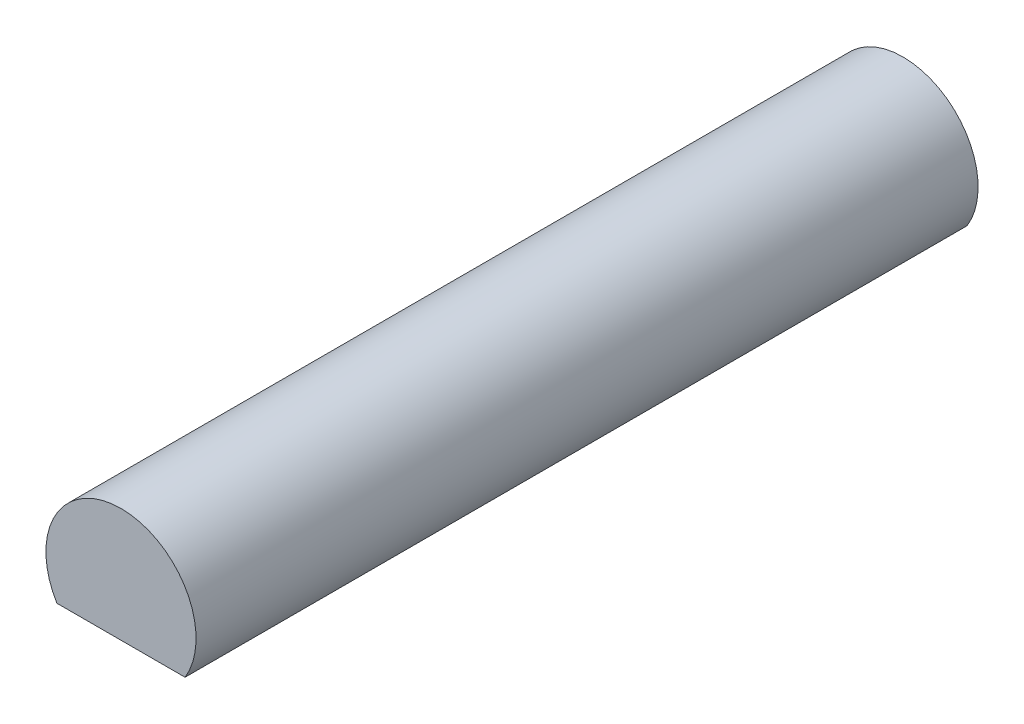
ISO-10303-21;
HEADER;
FILE_DESCRIPTION(('STEP AP214'),'2;1');
FILE_NAME('part.step','',(''),(''),'','','');
FILE_SCHEMA(('AUTOMOTIVE_DESIGN { 1 0 10303 214 1 1 1 1 }'));
ENDSEC;
DATA;
#1=APPLICATION_CONTEXT('core data for automotive mechanical design processes');
#2=APPLICATION_PROTOCOL_DEFINITION('international standard','automotive_design',2000,#1);
#3=PRODUCT_CONTEXT('',#1,'mechanical');
#4=PRODUCT('Part','Part','',(#3));
#5=PRODUCT_RELATED_PRODUCT_CATEGORY('part','',(#4));
#6=PRODUCT_DEFINITION_FORMATION('','',#4);
#7=PRODUCT_DEFINITION_CONTEXT('part definition',#1,'design');
#8=PRODUCT_DEFINITION('design','',#6,#7);
#9=PRODUCT_DEFINITION_SHAPE('','',#8);
#10=(LENGTH_UNIT() NAMED_UNIT(*) SI_UNIT(.MILLI.,.METRE.));
#11=(NAMED_UNIT(*) PLANE_ANGLE_UNIT() SI_UNIT($,.RADIAN.));
#12=(NAMED_UNIT(*) SI_UNIT($,.STERADIAN.) SOLID_ANGLE_UNIT());
#13=UNCERTAINTY_MEASURE_WITH_UNIT(LENGTH_MEASURE(1.E-05),#10,'distance_accuracy_value','');
#14=(GEOMETRIC_REPRESENTATION_CONTEXT(3) GLOBAL_UNCERTAINTY_ASSIGNED_CONTEXT((#13)) GLOBAL_UNIT_ASSIGNED_CONTEXT((#10,
#11,#12)) REPRESENTATION_CONTEXT('',''));
#15=CARTESIAN_POINT('',(0.,0.,0.));
#16=DIRECTION('',(0.,0.,1.));
#17=DIRECTION('',(1.,0.,0.));
#18=AXIS2_PLACEMENT_3D('',#15,#16,#17);
#19=CARTESIAN_POINT('',(0.,0.,25.));
#20=DIRECTION('',(0.,0.,-1.));
#21=DIRECTION('',(-1.,0.,0.));
#22=AXIS2_PLACEMENT_3D('',#19,#20,#21);
#23=CYLINDRICAL_SURFACE('',#22,2.4);
#24=CARTESIAN_POINT('',(0.,0.,0.));
#25=DIRECTION('',(0.,0.,1.));
#26=DIRECTION('',(1.,0.,0.));
#27=AXIS2_PLACEMENT_3D('',#24,#25,#26);
#28=CIRCLE('',#27,2.4);
#29=CARTESIAN_POINT('',(2.04878012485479,-1.25000000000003,0.));
#30=VERTEX_POINT('',#29);
#31=CARTESIAN_POINT('',(-2.04878012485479,-1.25000000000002,0.));
#32=VERTEX_POINT('',#31);
#33=EDGE_CURVE('E73',#30,#32,#28,.T.);
#34=ORIENTED_EDGE('',*,*,#33,.T.);
#35=DIRECTION('',(0.,0.,-1.));
#36=VECTOR('',#35,1.);
#37=CARTESIAN_POINT('',(-2.04878012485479,-1.25,25.));
#38=LINE('',#37,#36);
#39=CARTESIAN_POINT('',(-2.04878012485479,-1.25,25.));
#40=VERTEX_POINT('',#39);
#41=EDGE_CURVE('E11',#40,#32,#38,.T.);
#42=ORIENTED_EDGE('',*,*,#41,.F.);
#43=CARTESIAN_POINT('',(0.,0.,25.));
#44=DIRECTION('',(0.,0.,1.));
#45=DIRECTION('',(1.,0.,0.));
#46=AXIS2_PLACEMENT_3D('',#43,#44,#45);
#47=CIRCLE('',#46,2.4);
#48=CARTESIAN_POINT('',(2.04878012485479,-1.25000000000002,25.));
#49=VERTEX_POINT('',#48);
#50=EDGE_CURVE('E72',#49,#40,#47,.T.);
#51=ORIENTED_EDGE('',*,*,#50,.F.);
#52=DIRECTION('',(0.,0.,-1.));
#53=VECTOR('',#52,1.);
#54=CARTESIAN_POINT('',(2.04878012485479,-1.25000000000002,25.));
#55=LINE('',#54,#53);
#56=EDGE_CURVE('E49',#49,#30,#55,.T.);
#57=ORIENTED_EDGE('',*,*,#56,.T.);
#58=EDGE_LOOP('',(#34,#42,#51,#57));
#59=FACE_BOUND('',#58,.T.);
#60=ADVANCED_FACE('F40',(#59),#23,.T.);
#61=CARTESIAN_POINT('',(-2.04878012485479,-1.25,25.));
#62=DIRECTION('',(0.,1.,0.));
#63=DIRECTION('',(0.,0.,1.));
#64=AXIS2_PLACEMENT_3D('',#61,#62,#63);
#65=PLANE('',#64);
#66=DIRECTION('',(1.,0.,0.));
#67=VECTOR('',#66,1.);
#68=CARTESIAN_POINT('',(-2.04878012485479,-1.25000000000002,0.));
#69=LINE('',#68,#67);
#70=EDGE_CURVE('E64',#32,#30,#69,.T.);
#71=ORIENTED_EDGE('',*,*,#70,.T.);
#72=ORIENTED_EDGE('',*,*,#56,.F.);
#73=DIRECTION('',(1.,0.,0.));
#74=VECTOR('',#73,1.);
#75=CARTESIAN_POINT('',(-2.04878012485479,-1.25,25.));
#76=LINE('',#75,#74);
#77=EDGE_CURVE('E56',#40,#49,#76,.T.);
#78=ORIENTED_EDGE('',*,*,#77,.F.);
#79=ORIENTED_EDGE('',*,*,#41,.T.);
#80=EDGE_LOOP('',(#71,#72,#78,#79));
#81=FACE_BOUND('',#80,.T.);
#82=ADVANCED_FACE('F67',(#81),#65,.F.);
#83=CARTESIAN_POINT('',(0.,0.,25.));
#84=DIRECTION('',(0.,0.,1.));
#85=DIRECTION('',(1.,0.,0.));
#86=AXIS2_PLACEMENT_3D('',#83,#84,#85);
#87=PLANE('',#86);
#88=ORIENTED_EDGE('',*,*,#50,.T.);
#89=ORIENTED_EDGE('',*,*,#77,.T.);
#90=EDGE_LOOP('',(#88,#89));
#91=FACE_BOUND('',#90,.T.);
#92=ADVANCED_FACE('F86',(#91),#87,.T.);
#93=CARTESIAN_POINT('',(0.,0.,0.));
#94=DIRECTION('',(0.,0.,1.));
#95=DIRECTION('',(1.,0.,0.));
#96=AXIS2_PLACEMENT_3D('',#93,#94,#95);
#97=PLANE('',#96);
#98=ORIENTED_EDGE('',*,*,#33,.F.);
#99=ORIENTED_EDGE('',*,*,#70,.F.);
#100=EDGE_LOOP('',(#98,#99));
#101=FACE_BOUND('',#100,.T.);
#102=ADVANCED_FACE('F77',(#101),#97,.F.);
#103=CLOSED_SHELL('',(#60,#82,#92,#102));
#104=MANIFOLD_SOLID_BREP('B2',#103);
#105=ADVANCED_BREP_SHAPE_REPRESENTATION('',(#18,#104),#14);
#106=SHAPE_DEFINITION_REPRESENTATION(#9,#105);
ENDSEC;
END-ISO-10303-21;
